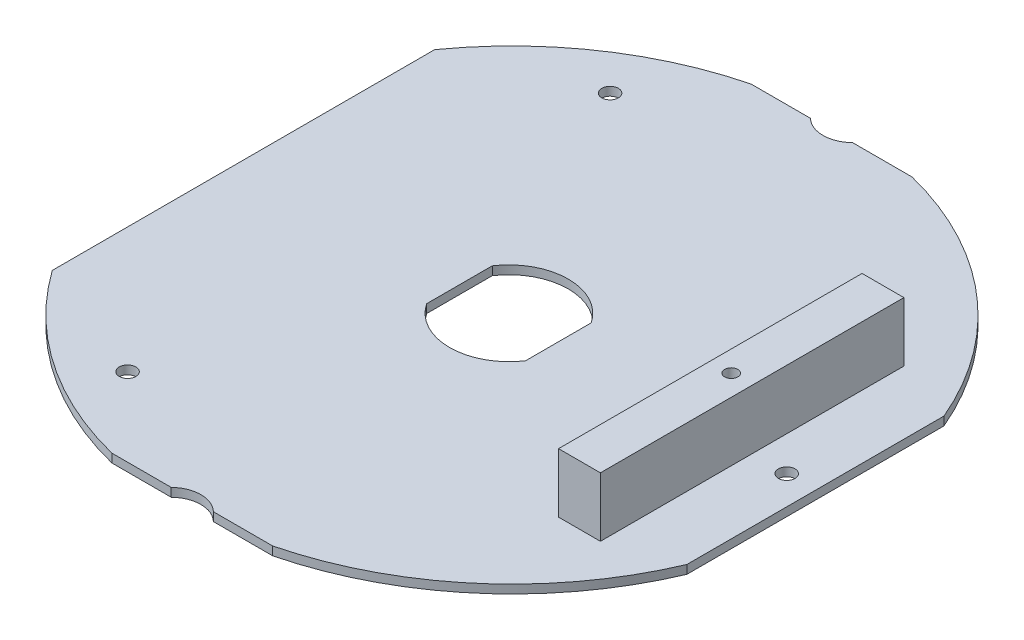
ISO-10303-21;
HEADER;
FILE_DESCRIPTION(('STEP AP214'),'2;1');
FILE_NAME('part.step','',(''),(''),'','','');
FILE_SCHEMA(('AUTOMOTIVE_DESIGN { 1 0 10303 214 1 1 1 1 }'));
ENDSEC;
DATA;
#1=APPLICATION_CONTEXT('core data for automotive mechanical design processes');
#2=APPLICATION_PROTOCOL_DEFINITION('international standard','automotive_design',2000,#1);
#3=PRODUCT_CONTEXT('',#1,'mechanical');
#4=PRODUCT('Part','Part','',(#3));
#5=PRODUCT_RELATED_PRODUCT_CATEGORY('part','',(#4));
#6=PRODUCT_DEFINITION_FORMATION('','',#4);
#7=PRODUCT_DEFINITION_CONTEXT('part definition',#1,'design');
#8=PRODUCT_DEFINITION('design','',#6,#7);
#9=PRODUCT_DEFINITION_SHAPE('','',#8);
#10=(LENGTH_UNIT() NAMED_UNIT(*) SI_UNIT(.MILLI.,.METRE.));
#11=(NAMED_UNIT(*) PLANE_ANGLE_UNIT() SI_UNIT($,.RADIAN.));
#12=(NAMED_UNIT(*) SI_UNIT($,.STERADIAN.) SOLID_ANGLE_UNIT());
#13=UNCERTAINTY_MEASURE_WITH_UNIT(LENGTH_MEASURE(1.E-05),#10,'distance_accuracy_value','');
#14=(GEOMETRIC_REPRESENTATION_CONTEXT(3) GLOBAL_UNCERTAINTY_ASSIGNED_CONTEXT((#13)) GLOBAL_UNIT_ASSIGNED_CONTEXT((#10,
#11,#12)) REPRESENTATION_CONTEXT('',''));
#15=CARTESIAN_POINT('',(0.,0.,0.));
#16=DIRECTION('',(0.,0.,1.));
#17=DIRECTION('',(1.,0.,0.));
#18=AXIS2_PLACEMENT_3D('',#15,#16,#17);
#19=CARTESIAN_POINT('',(0.,1.651,0.));
#20=DIRECTION('',(0.,1.,0.));
#21=DIRECTION('',(0.,0.,1.));
#22=AXIS2_PLACEMENT_3D('',#19,#20,#21);
#23=PLANE('',#22);
#24=DIRECTION('',(0.,0.,1.));
#25=VECTOR('',#24,1.);
#26=CARTESIAN_POINT('',(-10.1082566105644,1.651,6.31817022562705));
#27=LINE('',#26,#25);
#28=CARTESIAN_POINT('',(-10.1082566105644,1.651,-6.31817022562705));
#29=VERTEX_POINT('',#28);
#30=CARTESIAN_POINT('',(-10.1082566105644,1.651,6.31817022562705));
#31=VERTEX_POINT('',#30);
#32=EDGE_CURVE('E204',#29,#31,#27,.T.);
#33=ORIENTED_EDGE('',*,*,#32,.F.);
#34=CARTESIAN_POINT('',(-0.583256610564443,1.651,0.));
#35=DIRECTION('',(0.,1.,0.));
#36=DIRECTION('',(0.,0.,1.));
#37=AXIS2_PLACEMENT_3D('',#34,#35,#36);
#38=CIRCLE('',#37,11.43);
#39=CARTESIAN_POINT('',(8.94174338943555,1.651,-6.31817022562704));
#40=VERTEX_POINT('',#39);
#41=EDGE_CURVE('E202',#40,#29,#38,.T.);
#42=ORIENTED_EDGE('',*,*,#41,.F.);
#43=DIRECTION('',(0.,0.,-1.));
#44=VECTOR('',#43,1.);
#45=CARTESIAN_POINT('',(8.94174338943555,1.651,-6.31817022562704));
#46=LINE('',#45,#44);
#47=CARTESIAN_POINT('',(8.94174338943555,1.651,6.31817022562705));
#48=VERTEX_POINT('',#47);
#49=EDGE_CURVE('E209',#48,#40,#46,.T.);
#50=ORIENTED_EDGE('',*,*,#49,.F.);
#51=CARTESIAN_POINT('',(-0.583256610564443,1.651,0.));
#52=DIRECTION('',(0.,1.,0.));
#53=DIRECTION('',(0.,0.,1.));
#54=AXIS2_PLACEMENT_3D('',#51,#52,#53);
#55=CIRCLE('',#54,11.43);
#56=EDGE_CURVE('E207',#31,#48,#55,.T.);
#57=ORIENTED_EDGE('',*,*,#56,.F.);
#58=EDGE_LOOP('',(#33,#42,#50,#57));
#59=FACE_BOUND('',#58,.T.);
#60=CARTESIAN_POINT('',(-27.574642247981,1.651,-46.482));
#61=DIRECTION('',(0.,1.,0.));
#62=DIRECTION('',(0.,0.,1.));
#63=AXIS2_PLACEMENT_3D('',#60,#61,#62);
#64=CIRCLE('',#63,1.6002);
#65=CARTESIAN_POINT('',(-27.574642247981,1.651,-48.0822));
#66=VERTEX_POINT('',#65);
#67=EDGE_CURVE('E234',#66,#66,#64,.T.);
#68=ORIENTED_EDGE('',*,*,#67,.F.);
#69=EDGE_LOOP('',(#68));
#70=FACE_BOUND('',#69,.T.);
#71=CARTESIAN_POINT('',(0.,1.651,0.));
#72=DIRECTION('',(0.,1.,0.));
#73=DIRECTION('',(0.,0.,1.));
#74=AXIS2_PLACEMENT_3D('',#71,#72,#73);
#75=CIRCLE('',#74,63.5);
#76=CARTESIAN_POINT('',(15.494,1.651,61.5807272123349));
#77=VERTEX_POINT('',#76);
#78=CARTESIAN_POINT('',(58.4717433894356,1.651,24.765));
#79=VERTEX_POINT('',#78);
#80=EDGE_CURVE('E246',#77,#79,#75,.T.);
#81=ORIENTED_EDGE('',*,*,#80,.T.);
#82=DIRECTION('',(0.,0.,-1.));
#83=VECTOR('',#82,1.);
#84=CARTESIAN_POINT('',(58.4717433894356,1.651,0.));
#85=LINE('',#84,#83);
#86=CARTESIAN_POINT('',(58.4717433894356,1.651,-24.765));
#87=VERTEX_POINT('',#86);
#88=EDGE_CURVE('E249',#79,#87,#85,.T.);
#89=ORIENTED_EDGE('',*,*,#88,.T.);
#90=CARTESIAN_POINT('',(0.,1.651,0.));
#91=DIRECTION('',(0.,1.,0.));
#92=DIRECTION('',(0.,0.,1.));
#93=AXIS2_PLACEMENT_3D('',#90,#91,#92);
#94=CIRCLE('',#93,63.5);
#95=CARTESIAN_POINT('',(15.494,1.651,-61.5807272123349));
#96=VERTEX_POINT('',#95);
#97=EDGE_CURVE('E252',#87,#96,#94,.T.);
#98=ORIENTED_EDGE('',*,*,#97,.T.);
#99=DIRECTION('',(-1.,0.,0.));
#100=VECTOR('',#99,1.);
#101=CARTESIAN_POINT('',(15.494,1.651,-61.5807272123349));
#102=LINE('',#101,#100);
#103=CARTESIAN_POINT('',(4.064,1.651,-61.5807272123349));
#104=VERTEX_POINT('',#103);
#105=EDGE_CURVE('E254',#96,#104,#102,.T.);
#106=ORIENTED_EDGE('',*,*,#105,.T.);
#107=CARTESIAN_POINT('',(0.,1.651,-65.757073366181));
#108=DIRECTION('',(0.,-1.,0.));
#109=DIRECTION('',(0.,0.,1.));
#110=AXIS2_PLACEMENT_3D('',#107,#108,#109);
#111=CIRCLE('',#110,5.82734615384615);
#112=CARTESIAN_POINT('',(-4.06399999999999,1.651,-61.5807272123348));
#113=VERTEX_POINT('',#112);
#114=EDGE_CURVE('E256',#104,#113,#111,.T.);
#115=ORIENTED_EDGE('',*,*,#114,.T.);
#116=DIRECTION('',(-1.,0.,0.));
#117=VECTOR('',#116,1.);
#118=CARTESIAN_POINT('',(-4.064,1.651,-61.5807272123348));
#119=LINE('',#118,#117);
#120=CARTESIAN_POINT('',(-15.494,1.651,-61.5807272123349));
#121=VERTEX_POINT('',#120);
#122=EDGE_CURVE('E258',#113,#121,#119,.T.);
#123=ORIENTED_EDGE('',*,*,#122,.T.);
#124=CARTESIAN_POINT('',(0.,1.651,0.));
#125=DIRECTION('',(0.,1.,0.));
#126=DIRECTION('',(0.,0.,1.));
#127=AXIS2_PLACEMENT_3D('',#124,#125,#126);
#128=CIRCLE('',#127,63.5);
#129=CARTESIAN_POINT('',(-51.7281461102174,1.651,-36.83));
#130=VERTEX_POINT('',#129);
#131=EDGE_CURVE('E260',#121,#130,#128,.T.);
#132=ORIENTED_EDGE('',*,*,#131,.T.);
#133=DIRECTION('',(0.,0.,1.));
#134=VECTOR('',#133,1.);
#135=CARTESIAN_POINT('',(-51.7281461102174,1.651,-36.83));
#136=LINE('',#135,#134);
#137=CARTESIAN_POINT('',(-51.7281461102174,1.651,36.83));
#138=VERTEX_POINT('',#137);
#139=EDGE_CURVE('E262',#130,#138,#136,.T.);
#140=ORIENTED_EDGE('',*,*,#139,.T.);
#141=CARTESIAN_POINT('',(0.,1.651,0.));
#142=DIRECTION('',(0.,1.,0.));
#143=DIRECTION('',(0.,0.,1.));
#144=AXIS2_PLACEMENT_3D('',#141,#142,#143);
#145=CIRCLE('',#144,63.5);
#146=CARTESIAN_POINT('',(-15.494,1.651,61.5807272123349));
#147=VERTEX_POINT('',#146);
#148=EDGE_CURVE('E264',#138,#147,#145,.T.);
#149=ORIENTED_EDGE('',*,*,#148,.T.);
#150=DIRECTION('',(1.,0.,0.));
#151=VECTOR('',#150,1.);
#152=CARTESIAN_POINT('',(-4.064,1.651,61.5807272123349));
#153=LINE('',#152,#151);
#154=CARTESIAN_POINT('',(-4.064,1.651,61.5807272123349));
#155=VERTEX_POINT('',#154);
#156=EDGE_CURVE('E266',#147,#155,#153,.T.);
#157=ORIENTED_EDGE('',*,*,#156,.T.);
#158=CARTESIAN_POINT('',(0.,1.651,65.757073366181));
#159=DIRECTION('',(0.,-1.,0.));
#160=DIRECTION('',(0.,0.,1.));
#161=AXIS2_PLACEMENT_3D('',#158,#159,#160);
#162=CIRCLE('',#161,5.82734615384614);
#163=CARTESIAN_POINT('',(4.06399999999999,1.651,61.5807272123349));
#164=VERTEX_POINT('',#163);
#165=EDGE_CURVE('E268',#155,#164,#162,.T.);
#166=ORIENTED_EDGE('',*,*,#165,.T.);
#167=DIRECTION('',(1.,0.,0.));
#168=VECTOR('',#167,1.);
#169=CARTESIAN_POINT('',(15.494,1.651,61.5807272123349));
#170=LINE('',#169,#168);
#171=EDGE_CURVE('E270',#164,#77,#170,.T.);
#172=ORIENTED_EDGE('',*,*,#171,.T.);
#173=EDGE_LOOP('',(#81,#89,#98,#106,#115,#123,#132,#140,#149,#157,#166,#172));
#174=FACE_BOUND('',#173,.T.);
#175=CARTESIAN_POINT('',(-27.574642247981,1.651,46.482));
#176=DIRECTION('',(0.,1.,0.));
#177=DIRECTION('',(0.,0.,1.));
#178=AXIS2_PLACEMENT_3D('',#175,#176,#177);
#179=CIRCLE('',#178,1.6002);
#180=CARTESIAN_POINT('',(-27.574642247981,1.651,44.8818));
#181=VERTEX_POINT('',#180);
#182=EDGE_CURVE('E240',#181,#181,#179,.T.);
#183=ORIENTED_EDGE('',*,*,#182,.F.);
#184=EDGE_LOOP('',(#183));
#185=FACE_BOUND('',#184,.T.);
#186=CARTESIAN_POINT('',(52.9345433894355,1.651,0.));
#187=DIRECTION('',(0.,1.,0.));
#188=DIRECTION('',(0.,0.,1.));
#189=AXIS2_PLACEMENT_3D('',#186,#187,#188);
#190=CIRCLE('',#189,1.6002);
#191=CARTESIAN_POINT('',(52.9345433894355,1.651,-1.6002));
#192=VERTEX_POINT('',#191);
#193=EDGE_CURVE('E228',#192,#192,#190,.T.);
#194=ORIENTED_EDGE('',*,*,#193,.F.);
#195=EDGE_LOOP('',(#194));
#196=FACE_BOUND('',#195,.T.);
#197=DIRECTION('',(1.,0.,0.));
#198=VECTOR('',#197,1.);
#199=CARTESIAN_POINT('',(38.2152433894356,1.651,29.2354));
#200=LINE('',#199,#198);
#201=CARTESIAN_POINT('',(38.2152433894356,1.651,29.2354));
#202=VERTEX_POINT('',#201);
#203=CARTESIAN_POINT('',(46.2797433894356,1.651,29.2354));
#204=VERTEX_POINT('',#203);
#205=EDGE_CURVE('E645',#202,#204,#200,.T.);
#206=ORIENTED_EDGE('',*,*,#205,.F.);
#207=DIRECTION('',(0.,0.,1.));
#208=VECTOR('',#207,1.);
#209=CARTESIAN_POINT('',(38.2152433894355,1.651,-29.2354));
#210=LINE('',#209,#208);
#211=CARTESIAN_POINT('',(38.2152433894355,1.651,-29.2354));
#212=VERTEX_POINT('',#211);
#213=EDGE_CURVE('E192',#212,#202,#210,.T.);
#214=ORIENTED_EDGE('',*,*,#213,.F.);
#215=DIRECTION('',(-1.,0.,0.));
#216=VECTOR('',#215,1.);
#217=CARTESIAN_POINT('',(38.2152433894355,1.651,-29.2354));
#218=LINE('',#217,#216);
#219=CARTESIAN_POINT('',(46.2797433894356,1.651,-29.2354));
#220=VERTEX_POINT('',#219);
#221=EDGE_CURVE('E188',#220,#212,#218,.T.);
#222=ORIENTED_EDGE('',*,*,#221,.F.);
#223=DIRECTION('',(0.,0.,-1.));
#224=VECTOR('',#223,1.);
#225=CARTESIAN_POINT('',(46.2797433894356,1.651,-29.2354));
#226=LINE('',#225,#224);
#227=EDGE_CURVE('E654',#204,#220,#226,.T.);
#228=ORIENTED_EDGE('',*,*,#227,.F.);
#229=EDGE_LOOP('',(#206,#214,#222,#228));
#230=FACE_BOUND('',#229,.T.);
#231=ADVANCED_FACE('F32',(#59,#70,#174,#185,#196,#230),#23,.T.);
#232=CARTESIAN_POINT('',(0.,0.,0.));
#233=DIRECTION('',(0.,1.,0.));
#234=DIRECTION('',(0.,0.,1.));
#235=AXIS2_PLACEMENT_3D('',#232,#233,#234);
#236=PLANE('',#235);
#237=CARTESIAN_POINT('',(52.9345433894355,0.,0.));
#238=DIRECTION('',(0.,1.,0.));
#239=DIRECTION('',(0.,0.,1.));
#240=AXIS2_PLACEMENT_3D('',#237,#238,#239);
#241=CIRCLE('',#240,1.6002);
#242=CARTESIAN_POINT('',(52.9345433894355,0.,-1.6002));
#243=VERTEX_POINT('',#242);
#244=EDGE_CURVE('E227',#243,#243,#241,.T.);
#245=ORIENTED_EDGE('',*,*,#244,.T.);
#246=EDGE_LOOP('',(#245));
#247=FACE_BOUND('',#246,.T.);
#248=CARTESIAN_POINT('',(-27.574642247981,0.,46.482));
#249=DIRECTION('',(0.,1.,0.));
#250=DIRECTION('',(0.,0.,1.));
#251=AXIS2_PLACEMENT_3D('',#248,#249,#250);
#252=CIRCLE('',#251,1.6002);
#253=CARTESIAN_POINT('',(-27.574642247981,0.,44.8818));
#254=VERTEX_POINT('',#253);
#255=EDGE_CURVE('E237',#254,#254,#252,.T.);
#256=ORIENTED_EDGE('',*,*,#255,.T.);
#257=EDGE_LOOP('',(#256));
#258=FACE_BOUND('',#257,.T.);
#259=CARTESIAN_POINT('',(0.,0.,0.));
#260=DIRECTION('',(0.,1.,0.));
#261=DIRECTION('',(0.,0.,1.));
#262=AXIS2_PLACEMENT_3D('',#259,#260,#261);
#263=CIRCLE('',#262,63.5);
#264=CARTESIAN_POINT('',(15.494,0.,61.5807272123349));
#265=VERTEX_POINT('',#264);
#266=CARTESIAN_POINT('',(58.4717433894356,0.,24.765));
#267=VERTEX_POINT('',#266);
#268=EDGE_CURVE('E243',#265,#267,#263,.T.);
#269=ORIENTED_EDGE('',*,*,#268,.F.);
#270=DIRECTION('',(1.,0.,0.));
#271=VECTOR('',#270,1.);
#272=CARTESIAN_POINT('',(15.494,0.,61.5807272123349));
#273=LINE('',#272,#271);
#274=CARTESIAN_POINT('',(4.06399999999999,0.,61.5807272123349));
#275=VERTEX_POINT('',#274);
#276=EDGE_CURVE('E250',#275,#265,#273,.T.);
#277=ORIENTED_EDGE('',*,*,#276,.F.);
#278=CARTESIAN_POINT('',(0.,0.,65.757073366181));
#279=DIRECTION('',(0.,-1.,0.));
#280=DIRECTION('',(0.,0.,1.));
#281=AXIS2_PLACEMENT_3D('',#278,#279,#280);
#282=CIRCLE('',#281,5.82734615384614);
#283=CARTESIAN_POINT('',(-4.064,0.,61.5807272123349));
#284=VERTEX_POINT('',#283);
#285=EDGE_CURVE('E294',#284,#275,#282,.T.);
#286=ORIENTED_EDGE('',*,*,#285,.F.);
#287=DIRECTION('',(1.,0.,0.));
#288=VECTOR('',#287,1.);
#289=CARTESIAN_POINT('',(-4.064,0.,61.5807272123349));
#290=LINE('',#289,#288);
#291=CARTESIAN_POINT('',(-15.494,0.,61.5807272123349));
#292=VERTEX_POINT('',#291);
#293=EDGE_CURVE('E292',#292,#284,#290,.T.);
#294=ORIENTED_EDGE('',*,*,#293,.F.);
#295=CARTESIAN_POINT('',(0.,0.,0.));
#296=DIRECTION('',(0.,1.,0.));
#297=DIRECTION('',(0.,0.,1.));
#298=AXIS2_PLACEMENT_3D('',#295,#296,#297);
#299=CIRCLE('',#298,63.5);
#300=CARTESIAN_POINT('',(-51.7281461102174,0.,36.83));
#301=VERTEX_POINT('',#300);
#302=EDGE_CURVE('E290',#301,#292,#299,.T.);
#303=ORIENTED_EDGE('',*,*,#302,.F.);
#304=DIRECTION('',(0.,0.,1.));
#305=VECTOR('',#304,1.);
#306=CARTESIAN_POINT('',(-51.7281461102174,0.,0.));
#307=LINE('',#306,#305);
#308=CARTESIAN_POINT('',(-51.7281461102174,0.,-36.83));
#309=VERTEX_POINT('',#308);
#310=EDGE_CURVE('E288',#309,#301,#307,.T.);
#311=ORIENTED_EDGE('',*,*,#310,.F.);
#312=CARTESIAN_POINT('',(0.,0.,0.));
#313=DIRECTION('',(0.,1.,0.));
#314=DIRECTION('',(0.,0.,1.));
#315=AXIS2_PLACEMENT_3D('',#312,#313,#314);
#316=CIRCLE('',#315,63.5);
#317=CARTESIAN_POINT('',(-15.494,0.,-61.5807272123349));
#318=VERTEX_POINT('',#317);
#319=EDGE_CURVE('E285',#318,#309,#316,.T.);
#320=ORIENTED_EDGE('',*,*,#319,.F.);
#321=DIRECTION('',(-1.,0.,0.));
#322=VECTOR('',#321,1.);
#323=CARTESIAN_POINT('',(-4.064,0.,-61.5807272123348));
#324=LINE('',#323,#322);
#325=CARTESIAN_POINT('',(-4.06399999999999,0.,-61.5807272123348));
#326=VERTEX_POINT('',#325);
#327=EDGE_CURVE('E283',#326,#318,#324,.T.);
#328=ORIENTED_EDGE('',*,*,#327,.F.);
#329=CARTESIAN_POINT('',(0.,0.,-65.757073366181));
#330=DIRECTION('',(0.,-1.,0.));
#331=DIRECTION('',(0.,0.,1.));
#332=AXIS2_PLACEMENT_3D('',#329,#330,#331);
#333=CIRCLE('',#332,5.82734615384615);
#334=CARTESIAN_POINT('',(4.064,0.,-61.5807272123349));
#335=VERTEX_POINT('',#334);
#336=EDGE_CURVE('E281',#335,#326,#333,.T.);
#337=ORIENTED_EDGE('',*,*,#336,.F.);
#338=DIRECTION('',(-1.,0.,0.));
#339=VECTOR('',#338,1.);
#340=CARTESIAN_POINT('',(15.494,0.,-61.5807272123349));
#341=LINE('',#340,#339);
#342=CARTESIAN_POINT('',(15.494,0.,-61.5807272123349));
#343=VERTEX_POINT('',#342);
#344=EDGE_CURVE('E279',#343,#335,#341,.T.);
#345=ORIENTED_EDGE('',*,*,#344,.F.);
#346=CARTESIAN_POINT('',(0.,0.,0.));
#347=DIRECTION('',(0.,1.,0.));
#348=DIRECTION('',(0.,0.,1.));
#349=AXIS2_PLACEMENT_3D('',#346,#347,#348);
#350=CIRCLE('',#349,63.5);
#351=CARTESIAN_POINT('',(58.4717433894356,0.,-24.765));
#352=VERTEX_POINT('',#351);
#353=EDGE_CURVE('E277',#352,#343,#350,.T.);
#354=ORIENTED_EDGE('',*,*,#353,.F.);
#355=DIRECTION('',(0.,0.,-1.));
#356=VECTOR('',#355,1.);
#357=CARTESIAN_POINT('',(58.4717433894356,0.,-24.765));
#358=LINE('',#357,#356);
#359=EDGE_CURVE('E275',#267,#352,#358,.T.);
#360=ORIENTED_EDGE('',*,*,#359,.F.);
#361=EDGE_LOOP('',(#269,#277,#286,#294,#303,#311,#320,#328,#337,#345,#354,#360));
#362=FACE_BOUND('',#361,.T.);
#363=CARTESIAN_POINT('',(-27.574642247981,0.,-46.482));
#364=DIRECTION('',(0.,1.,0.));
#365=DIRECTION('',(0.,0.,1.));
#366=AXIS2_PLACEMENT_3D('',#363,#364,#365);
#367=CIRCLE('',#366,1.6002);
#368=CARTESIAN_POINT('',(-27.574642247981,0.,-48.0822));
#369=VERTEX_POINT('',#368);
#370=EDGE_CURVE('E231',#369,#369,#367,.T.);
#371=ORIENTED_EDGE('',*,*,#370,.T.);
#372=EDGE_LOOP('',(#371));
#373=FACE_BOUND('',#372,.T.);
#374=CARTESIAN_POINT('',(-0.583256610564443,0.,0.));
#375=DIRECTION('',(0.,1.,0.));
#376=DIRECTION('',(0.,0.,1.));
#377=AXIS2_PLACEMENT_3D('',#374,#375,#376);
#378=CIRCLE('',#377,11.43);
#379=CARTESIAN_POINT('',(8.94174338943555,0.,-6.31817022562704));
#380=VERTEX_POINT('',#379);
#381=CARTESIAN_POINT('',(-10.1082566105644,0.,-6.31817022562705));
#382=VERTEX_POINT('',#381);
#383=EDGE_CURVE('E194',#380,#382,#378,.T.);
#384=ORIENTED_EDGE('',*,*,#383,.T.);
#385=DIRECTION('',(0.,0.,1.));
#386=VECTOR('',#385,1.);
#387=CARTESIAN_POINT('',(-10.1082566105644,0.,6.31817022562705));
#388=LINE('',#387,#386);
#389=CARTESIAN_POINT('',(-10.1082566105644,0.,6.31817022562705));
#390=VERTEX_POINT('',#389);
#391=EDGE_CURVE('E197',#382,#390,#388,.T.);
#392=ORIENTED_EDGE('',*,*,#391,.T.);
#393=CARTESIAN_POINT('',(-0.583256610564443,0.,0.));
#394=DIRECTION('',(0.,1.,0.));
#395=DIRECTION('',(0.,0.,1.));
#396=AXIS2_PLACEMENT_3D('',#393,#394,#395);
#397=CIRCLE('',#396,11.43);
#398=CARTESIAN_POINT('',(8.94174338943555,0.,6.31817022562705));
#399=VERTEX_POINT('',#398);
#400=EDGE_CURVE('E214',#390,#399,#397,.T.);
#401=ORIENTED_EDGE('',*,*,#400,.T.);
#402=DIRECTION('',(0.,0.,-1.));
#403=VECTOR('',#402,1.);
#404=CARTESIAN_POINT('',(8.94174338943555,0.,-6.31817022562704));
#405=LINE('',#404,#403);
#406=EDGE_CURVE('E205',#399,#380,#405,.T.);
#407=ORIENTED_EDGE('',*,*,#406,.T.);
#408=EDGE_LOOP('',(#384,#392,#401,#407));
#409=FACE_BOUND('',#408,.T.);
#410=ADVANCED_FACE('F336',(#247,#258,#362,#373,#409),#236,.F.);
#411=CARTESIAN_POINT('',(0.,1.651,0.));
#412=DIRECTION('',(0.,-1.,0.));
#413=DIRECTION('',(0.,0.,-1.));
#414=AXIS2_PLACEMENT_3D('',#411,#412,#413);
#415=CYLINDRICAL_SURFACE('',#414,63.5);
#416=ORIENTED_EDGE('',*,*,#268,.T.);
#417=DIRECTION('',(0.,-1.,0.));
#418=VECTOR('',#417,1.);
#419=CARTESIAN_POINT('',(58.4717433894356,1.651,24.765));
#420=LINE('',#419,#418);
#421=EDGE_CURVE('E11',#79,#267,#420,.T.);
#422=ORIENTED_EDGE('',*,*,#421,.F.);
#423=ORIENTED_EDGE('',*,*,#80,.F.);
#424=DIRECTION('',(0.,-1.,0.));
#425=VECTOR('',#424,1.);
#426=CARTESIAN_POINT('',(15.494,1.651,61.5807272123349));
#427=LINE('',#426,#425);
#428=EDGE_CURVE('E272',#77,#265,#427,.T.);
#429=ORIENTED_EDGE('',*,*,#428,.T.);
#430=EDGE_LOOP('',(#416,#422,#423,#429));
#431=FACE_BOUND('',#430,.T.);
#432=ADVANCED_FACE('F34',(#431),#415,.T.);
#433=CARTESIAN_POINT('',(58.4717433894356,1.651,-24.765));
#434=DIRECTION('',(-1.,0.,0.));
#435=DIRECTION('',(0.,0.,1.));
#436=AXIS2_PLACEMENT_3D('',#433,#434,#435);
#437=PLANE('',#436);
#438=ORIENTED_EDGE('',*,*,#359,.T.);
#439=DIRECTION('',(0.,-1.,0.));
#440=VECTOR('',#439,1.);
#441=CARTESIAN_POINT('',(58.4717433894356,1.651,-24.765));
#442=LINE('',#441,#440);
#443=EDGE_CURVE('E40',#87,#352,#442,.T.);
#444=ORIENTED_EDGE('',*,*,#443,.F.);
#445=ORIENTED_EDGE('',*,*,#88,.F.);
#446=ORIENTED_EDGE('',*,*,#421,.T.);
#447=EDGE_LOOP('',(#438,#444,#445,#446));
#448=FACE_BOUND('',#447,.T.);
#449=ADVANCED_FACE('F354',(#448),#437,.F.);
#450=CARTESIAN_POINT('',(0.,1.651,0.));
#451=DIRECTION('',(0.,-1.,0.));
#452=DIRECTION('',(0.,0.,-1.));
#453=AXIS2_PLACEMENT_3D('',#450,#451,#452);
#454=CYLINDRICAL_SURFACE('',#453,63.5);
#455=ORIENTED_EDGE('',*,*,#353,.T.);
#456=DIRECTION('',(0.,-1.,0.));
#457=VECTOR('',#456,1.);
#458=CARTESIAN_POINT('',(15.494,1.651,-61.5807272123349));
#459=LINE('',#458,#457);
#460=EDGE_CURVE('E323',#96,#343,#459,.T.);
#461=ORIENTED_EDGE('',*,*,#460,.F.);
#462=ORIENTED_EDGE('',*,*,#97,.F.);
#463=ORIENTED_EDGE('',*,*,#443,.T.);
#464=EDGE_LOOP('',(#455,#461,#462,#463));
#465=FACE_BOUND('',#464,.T.);
#466=ADVANCED_FACE('F330',(#465),#454,.T.);
#467=CARTESIAN_POINT('',(15.494,1.651,-61.5807272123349));
#468=DIRECTION('',(0.,0.,1.));
#469=DIRECTION('',(1.,0.,0.));
#470=AXIS2_PLACEMENT_3D('',#467,#468,#469);
#471=PLANE('',#470);
#472=ORIENTED_EDGE('',*,*,#344,.T.);
#473=DIRECTION('',(0.,-1.,0.));
#474=VECTOR('',#473,1.);
#475=CARTESIAN_POINT('',(4.064,1.651,-61.5807272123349));
#476=LINE('',#475,#474);
#477=EDGE_CURVE('E320',#104,#335,#476,.T.);
#478=ORIENTED_EDGE('',*,*,#477,.F.);
#479=ORIENTED_EDGE('',*,*,#105,.F.);
#480=ORIENTED_EDGE('',*,*,#460,.T.);
#481=EDGE_LOOP('',(#472,#478,#479,#480));
#482=FACE_BOUND('',#481,.T.);
#483=ADVANCED_FACE('F342',(#482),#471,.F.);
#484=CARTESIAN_POINT('',(0.,1.651,-65.757073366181));
#485=DIRECTION('',(0.,-1.,0.));
#486=DIRECTION('',(0.,0.,-1.));
#487=AXIS2_PLACEMENT_3D('',#484,#485,#486);
#488=CYLINDRICAL_SURFACE('',#487,5.82734615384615);
#489=ORIENTED_EDGE('',*,*,#336,.T.);
#490=DIRECTION('',(0.,-1.,0.));
#491=VECTOR('',#490,1.);
#492=CARTESIAN_POINT('',(-4.06399999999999,1.651,-61.5807272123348));
#493=LINE('',#492,#491);
#494=EDGE_CURVE('E317',#113,#326,#493,.T.);
#495=ORIENTED_EDGE('',*,*,#494,.F.);
#496=ORIENTED_EDGE('',*,*,#114,.F.);
#497=ORIENTED_EDGE('',*,*,#477,.T.);
#498=EDGE_LOOP('',(#489,#495,#496,#497));
#499=FACE_BOUND('',#498,.T.);
#500=ADVANCED_FACE('F346',(#499),#488,.F.);
#501=CARTESIAN_POINT('',(-4.064,1.651,-61.5807272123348));
#502=DIRECTION('',(0.,0.,1.));
#503=DIRECTION('',(1.,0.,0.));
#504=AXIS2_PLACEMENT_3D('',#501,#502,#503);
#505=PLANE('',#504);
#506=ORIENTED_EDGE('',*,*,#327,.T.);
#507=DIRECTION('',(0.,-1.,0.));
#508=VECTOR('',#507,1.);
#509=CARTESIAN_POINT('',(-15.494,1.651,-61.5807272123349));
#510=LINE('',#509,#508);
#511=EDGE_CURVE('E314',#121,#318,#510,.T.);
#512=ORIENTED_EDGE('',*,*,#511,.F.);
#513=ORIENTED_EDGE('',*,*,#122,.F.);
#514=ORIENTED_EDGE('',*,*,#494,.T.);
#515=EDGE_LOOP('',(#506,#512,#513,#514));
#516=FACE_BOUND('',#515,.T.);
#517=ADVANCED_FACE('F386',(#516),#505,.F.);
#518=CARTESIAN_POINT('',(0.,1.651,0.));
#519=DIRECTION('',(0.,-1.,0.));
#520=DIRECTION('',(0.,0.,-1.));
#521=AXIS2_PLACEMENT_3D('',#518,#519,#520);
#522=CYLINDRICAL_SURFACE('',#521,63.5);
#523=ORIENTED_EDGE('',*,*,#319,.T.);
#524=DIRECTION('',(0.,-1.,0.));
#525=VECTOR('',#524,1.);
#526=CARTESIAN_POINT('',(-51.7281461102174,1.651,-36.83));
#527=LINE('',#526,#525);
#528=EDGE_CURVE('E311',#130,#309,#527,.T.);
#529=ORIENTED_EDGE('',*,*,#528,.F.);
#530=ORIENTED_EDGE('',*,*,#131,.F.);
#531=ORIENTED_EDGE('',*,*,#511,.T.);
#532=EDGE_LOOP('',(#523,#529,#530,#531));
#533=FACE_BOUND('',#532,.T.);
#534=ADVANCED_FACE('F384',(#533),#522,.T.);
#535=CARTESIAN_POINT('',(-51.7281461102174,1.651,0.));
#536=DIRECTION('',(1.,0.,0.));
#537=DIRECTION('',(0.,0.,-1.));
#538=AXIS2_PLACEMENT_3D('',#535,#536,#537);
#539=PLANE('',#538);
#540=ORIENTED_EDGE('',*,*,#310,.T.);
#541=DIRECTION('',(0.,-1.,0.));
#542=VECTOR('',#541,1.);
#543=CARTESIAN_POINT('',(-51.7281461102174,1.651,36.83));
#544=LINE('',#543,#542);
#545=EDGE_CURVE('E308',#138,#301,#544,.T.);
#546=ORIENTED_EDGE('',*,*,#545,.F.);
#547=ORIENTED_EDGE('',*,*,#139,.F.);
#548=ORIENTED_EDGE('',*,*,#528,.T.);
#549=EDGE_LOOP('',(#540,#546,#547,#548));
#550=FACE_BOUND('',#549,.T.);
#551=ADVANCED_FACE('F380',(#550),#539,.F.);
#552=CARTESIAN_POINT('',(0.,1.651,0.));
#553=DIRECTION('',(0.,-1.,0.));
#554=DIRECTION('',(0.,0.,-1.));
#555=AXIS2_PLACEMENT_3D('',#552,#553,#554);
#556=CYLINDRICAL_SURFACE('',#555,63.5);
#557=ORIENTED_EDGE('',*,*,#302,.T.);
#558=DIRECTION('',(0.,-1.,0.));
#559=VECTOR('',#558,1.);
#560=CARTESIAN_POINT('',(-15.494,1.651,61.5807272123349));
#561=LINE('',#560,#559);
#562=EDGE_CURVE('E305',#147,#292,#561,.T.);
#563=ORIENTED_EDGE('',*,*,#562,.F.);
#564=ORIENTED_EDGE('',*,*,#148,.F.);
#565=ORIENTED_EDGE('',*,*,#545,.T.);
#566=EDGE_LOOP('',(#557,#563,#564,#565));
#567=FACE_BOUND('',#566,.T.);
#568=ADVANCED_FACE('F375',(#567),#556,.T.);
#569=CARTESIAN_POINT('',(-4.064,1.651,61.5807272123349));
#570=DIRECTION('',(0.,0.,-1.));
#571=DIRECTION('',(-1.,0.,0.));
#572=AXIS2_PLACEMENT_3D('',#569,#570,#571);
#573=PLANE('',#572);
#574=ORIENTED_EDGE('',*,*,#293,.T.);
#575=DIRECTION('',(0.,-1.,0.));
#576=VECTOR('',#575,1.);
#577=CARTESIAN_POINT('',(-4.064,1.651,61.5807272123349));
#578=LINE('',#577,#576);
#579=EDGE_CURVE('E302',#155,#284,#578,.T.);
#580=ORIENTED_EDGE('',*,*,#579,.F.);
#581=ORIENTED_EDGE('',*,*,#156,.F.);
#582=ORIENTED_EDGE('',*,*,#562,.T.);
#583=EDGE_LOOP('',(#574,#580,#581,#582));
#584=FACE_BOUND('',#583,.T.);
#585=ADVANCED_FACE('F370',(#584),#573,.F.);
#586=CARTESIAN_POINT('',(0.,1.651,65.757073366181));
#587=DIRECTION('',(0.,-1.,0.));
#588=DIRECTION('',(0.,0.,-1.));
#589=AXIS2_PLACEMENT_3D('',#586,#587,#588);
#590=CYLINDRICAL_SURFACE('',#589,5.82734615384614);
#591=ORIENTED_EDGE('',*,*,#285,.T.);
#592=DIRECTION('',(0.,-1.,0.));
#593=VECTOR('',#592,1.);
#594=CARTESIAN_POINT('',(4.06399999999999,1.651,61.5807272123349));
#595=LINE('',#594,#593);
#596=EDGE_CURVE('E299',#164,#275,#595,.T.);
#597=ORIENTED_EDGE('',*,*,#596,.F.);
#598=ORIENTED_EDGE('',*,*,#165,.F.);
#599=ORIENTED_EDGE('',*,*,#579,.T.);
#600=EDGE_LOOP('',(#591,#597,#598,#599));
#601=FACE_BOUND('',#600,.T.);
#602=ADVANCED_FACE('F366',(#601),#590,.F.);
#603=CARTESIAN_POINT('',(15.494,1.651,61.5807272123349));
#604=DIRECTION('',(0.,0.,-1.));
#605=DIRECTION('',(-1.,0.,0.));
#606=AXIS2_PLACEMENT_3D('',#603,#604,#605);
#607=PLANE('',#606);
#608=ORIENTED_EDGE('',*,*,#276,.T.);
#609=ORIENTED_EDGE('',*,*,#428,.F.);
#610=ORIENTED_EDGE('',*,*,#171,.F.);
#611=ORIENTED_EDGE('',*,*,#596,.T.);
#612=EDGE_LOOP('',(#608,#609,#610,#611));
#613=FACE_BOUND('',#612,.T.);
#614=ADVANCED_FACE('F361',(#613),#607,.F.);
#615=CARTESIAN_POINT('',(-27.574642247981,1.651,46.482));
#616=DIRECTION('',(0.,-1.,0.));
#617=DIRECTION('',(0.,0.,-1.));
#618=AXIS2_PLACEMENT_3D('',#615,#616,#617);
#619=CYLINDRICAL_SURFACE('',#618,1.6002);
#620=CARTESIAN_POINT('',(-27.574642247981,1.651,44.8818));
#621=CARTESIAN_POINT('',(-27.574642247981,1.63380208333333,44.8818));
#622=CARTESIAN_POINT('',(-27.574642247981,1.61660416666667,44.8818));
#623=CARTESIAN_POINT('',(-27.574642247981,1.58220833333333,44.8818));
#624=CARTESIAN_POINT('',(-27.574642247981,1.56501041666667,44.8818));
#625=CARTESIAN_POINT('',(-27.574642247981,1.53061458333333,44.8818));
#626=CARTESIAN_POINT('',(-27.574642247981,1.51341666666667,44.8818));
#627=CARTESIAN_POINT('',(-27.574642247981,1.47902083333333,44.8818));
#628=CARTESIAN_POINT('',(-27.574642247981,1.46182291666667,44.8818));
#629=CARTESIAN_POINT('',(-27.574642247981,1.42742708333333,44.8818));
#630=CARTESIAN_POINT('',(-27.574642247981,1.41022916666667,44.8818));
#631=CARTESIAN_POINT('',(-27.574642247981,1.37583333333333,44.8818));
#632=CARTESIAN_POINT('',(-27.574642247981,1.35863541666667,44.8818));
#633=CARTESIAN_POINT('',(-27.574642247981,1.32423958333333,44.8818));
#634=CARTESIAN_POINT('',(-27.574642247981,1.30704166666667,44.8818));
#635=CARTESIAN_POINT('',(-27.574642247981,1.27264583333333,44.8818));
#636=CARTESIAN_POINT('',(-27.574642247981,1.25544791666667,44.8818));
#637=CARTESIAN_POINT('',(-27.574642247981,1.22105208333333,44.8818));
#638=CARTESIAN_POINT('',(-27.574642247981,1.20385416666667,44.8818));
#639=CARTESIAN_POINT('',(-27.574642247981,1.16945833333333,44.8818));
#640=CARTESIAN_POINT('',(-27.574642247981,1.15226041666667,44.8818));
#641=CARTESIAN_POINT('',(-27.574642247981,1.11786458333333,44.8818));
#642=CARTESIAN_POINT('',(-27.574642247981,1.10066666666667,44.8818));
#643=CARTESIAN_POINT('',(-27.574642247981,1.06627083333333,44.8818));
#644=CARTESIAN_POINT('',(-27.574642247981,1.04907291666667,44.8818));
#645=CARTESIAN_POINT('',(-27.574642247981,1.01467708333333,44.8818));
#646=CARTESIAN_POINT('',(-27.574642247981,0.997479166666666,44.8818));
#647=CARTESIAN_POINT('',(-27.574642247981,0.963083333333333,44.8818));
#648=CARTESIAN_POINT('',(-27.574642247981,0.945885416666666,44.8818));
#649=CARTESIAN_POINT('',(-27.574642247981,0.911489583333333,44.8818));
#650=CARTESIAN_POINT('',(-27.574642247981,0.894291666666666,44.8818));
#651=CARTESIAN_POINT('',(-27.574642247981,0.859895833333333,44.8818));
#652=CARTESIAN_POINT('',(-27.574642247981,0.842697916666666,44.8818));
#653=CARTESIAN_POINT('',(-27.574642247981,0.808302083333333,44.8818));
#654=CARTESIAN_POINT('',(-27.574642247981,0.791104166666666,44.8818));
#655=CARTESIAN_POINT('',(-27.574642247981,0.756708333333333,44.8818));
#656=CARTESIAN_POINT('',(-27.574642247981,0.739510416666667,44.8818));
#657=CARTESIAN_POINT('',(-27.574642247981,0.705114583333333,44.8818));
#658=CARTESIAN_POINT('',(-27.574642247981,0.687916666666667,44.8818));
#659=CARTESIAN_POINT('',(-27.574642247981,0.653520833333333,44.8818));
#660=CARTESIAN_POINT('',(-27.574642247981,0.636322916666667,44.8818));
#661=CARTESIAN_POINT('',(-27.574642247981,0.601927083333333,44.8818));
#662=CARTESIAN_POINT('',(-27.574642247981,0.584729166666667,44.8818));
#663=CARTESIAN_POINT('',(-27.574642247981,0.550333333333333,44.8818));
#664=CARTESIAN_POINT('',(-27.574642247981,0.533135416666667,44.8818));
#665=CARTESIAN_POINT('',(-27.574642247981,0.498739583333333,44.8818));
#666=CARTESIAN_POINT('',(-27.574642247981,0.481541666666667,44.8818));
#667=CARTESIAN_POINT('',(-27.574642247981,0.447145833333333,44.8818));
#668=CARTESIAN_POINT('',(-27.574642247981,0.429947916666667,44.8818));
#669=CARTESIAN_POINT('',(-27.574642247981,0.395552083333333,44.8818));
#670=CARTESIAN_POINT('',(-27.574642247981,0.378354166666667,44.8818));
#671=CARTESIAN_POINT('',(-27.574642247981,0.343958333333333,44.8818));
#672=CARTESIAN_POINT('',(-27.574642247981,0.326760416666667,44.8818));
#673=CARTESIAN_POINT('',(-27.574642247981,0.292364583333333,44.8818));
#674=CARTESIAN_POINT('',(-27.574642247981,0.275166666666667,44.8818));
#675=CARTESIAN_POINT('',(-27.574642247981,0.240770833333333,44.8818));
#676=CARTESIAN_POINT('',(-27.574642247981,0.223572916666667,44.8818));
#677=CARTESIAN_POINT('',(-27.574642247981,0.189177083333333,44.8818));
#678=CARTESIAN_POINT('',(-27.574642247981,0.171979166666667,44.8818));
#679=CARTESIAN_POINT('',(-27.574642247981,0.137583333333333,44.8818));
#680=CARTESIAN_POINT('',(-27.574642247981,0.120385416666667,44.8818));
#681=CARTESIAN_POINT('',(-27.574642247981,0.0859895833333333,44.8818));
#682=CARTESIAN_POINT('',(-27.574642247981,0.0687916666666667,44.8818));
#683=CARTESIAN_POINT('',(-27.574642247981,0.0343958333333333,44.8818));
#684=CARTESIAN_POINT('',(-27.574642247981,0.0171979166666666,44.8818));
#685=CARTESIAN_POINT('',(-27.574642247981,0.,44.8818));
#686=B_SPLINE_CURVE_WITH_KNOTS('',3,(#620,#621,#622,#623,#624,#625,#626,#627,#628,#629,#630,
#631,#632,#633,#634,#635,#636,#637,#638,#639,#640,#641,#642,#643,#644,#645,#646,#647,#648,#649,
#650,#651,#652,#653,#654,#655,#656,#657,#658,#659,#660,#661,#662,#663,#664,#665,#666,#667,#668,
#669,#670,#671,#672,#673,#674,#675,#676,#677,#678,#679,#680,#681,#682,#683,#684,#685),
.UNSPECIFIED.,.F.,.F.,(4,2,2,2,2,2,2,2,2,2,2,2,2,2,2,2,2,2,2,2,2,2,2,2,2,2,2,2,2,2,2,2,4),(0.,
0.0515937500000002,0.1031875,0.15478125,0.206375,0.25796875,0.3095625,0.36115625,0.41275,
0.46434375,0.5159375,0.56753125,0.619125,0.67071875,0.7223125,0.77390625,0.8255,0.87709375,
0.9286875,0.98028125,1.031875,1.08346875,1.1350625,1.18665625,1.23825,1.28984375,1.3414375,
1.39303125,1.444625,1.49621875,1.5478125,1.59940625,1.651),.UNSPECIFIED.);
#687=EDGE_CURVE('BSEAM406',#181,#254,#686,.T.);
#688=ORIENTED_EDGE('',*,*,#182,.T.);
#689=ORIENTED_EDGE('',*,*,#255,.F.);
#690=ORIENTED_EDGE('',*,*,#687,.T.);
#691=ORIENTED_EDGE('',*,*,#687,.F.);
#692=EDGE_LOOP('',(#688,#690,#689,#691));
#693=FACE_BOUND('',#692,.T.);
#694=ADVANCED_FACE('F406',(#693),#619,.F.);
#695=CARTESIAN_POINT('',(-27.574642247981,1.651,-46.482));
#696=DIRECTION('',(0.,-1.,0.));
#697=DIRECTION('',(0.,0.,-1.));
#698=AXIS2_PLACEMENT_3D('',#695,#696,#697);
#699=CYLINDRICAL_SURFACE('',#698,1.6002);
#700=CARTESIAN_POINT('',(-27.574642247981,1.651,-48.0822));
#701=CARTESIAN_POINT('',(-27.574642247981,1.63380208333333,-48.0822));
#702=CARTESIAN_POINT('',(-27.574642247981,1.61660416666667,-48.0822));
#703=CARTESIAN_POINT('',(-27.574642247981,1.58220833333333,-48.0822));
#704=CARTESIAN_POINT('',(-27.574642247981,1.56501041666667,-48.0822));
#705=CARTESIAN_POINT('',(-27.574642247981,1.53061458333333,-48.0822));
#706=CARTESIAN_POINT('',(-27.574642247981,1.51341666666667,-48.0822));
#707=CARTESIAN_POINT('',(-27.574642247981,1.47902083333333,-48.0822));
#708=CARTESIAN_POINT('',(-27.574642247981,1.46182291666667,-48.0822));
#709=CARTESIAN_POINT('',(-27.574642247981,1.42742708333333,-48.0822));
#710=CARTESIAN_POINT('',(-27.574642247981,1.41022916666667,-48.0822));
#711=CARTESIAN_POINT('',(-27.574642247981,1.37583333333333,-48.0822));
#712=CARTESIAN_POINT('',(-27.574642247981,1.35863541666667,-48.0822));
#713=CARTESIAN_POINT('',(-27.574642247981,1.32423958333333,-48.0822));
#714=CARTESIAN_POINT('',(-27.574642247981,1.30704166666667,-48.0822));
#715=CARTESIAN_POINT('',(-27.574642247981,1.27264583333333,-48.0822));
#716=CARTESIAN_POINT('',(-27.574642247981,1.25544791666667,-48.0822));
#717=CARTESIAN_POINT('',(-27.574642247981,1.22105208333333,-48.0822));
#718=CARTESIAN_POINT('',(-27.574642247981,1.20385416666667,-48.0822));
#719=CARTESIAN_POINT('',(-27.574642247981,1.16945833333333,-48.0822));
#720=CARTESIAN_POINT('',(-27.574642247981,1.15226041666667,-48.0822));
#721=CARTESIAN_POINT('',(-27.574642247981,1.11786458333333,-48.0822));
#722=CARTESIAN_POINT('',(-27.574642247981,1.10066666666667,-48.0822));
#723=CARTESIAN_POINT('',(-27.574642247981,1.06627083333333,-48.0822));
#724=CARTESIAN_POINT('',(-27.574642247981,1.04907291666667,-48.0822));
#725=CARTESIAN_POINT('',(-27.574642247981,1.01467708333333,-48.0822));
#726=CARTESIAN_POINT('',(-27.574642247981,0.997479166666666,-48.0822));
#727=CARTESIAN_POINT('',(-27.574642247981,0.963083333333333,-48.0822));
#728=CARTESIAN_POINT('',(-27.574642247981,0.945885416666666,-48.0822));
#729=CARTESIAN_POINT('',(-27.574642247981,0.911489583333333,-48.0822));
#730=CARTESIAN_POINT('',(-27.574642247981,0.894291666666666,-48.0822));
#731=CARTESIAN_POINT('',(-27.574642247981,0.859895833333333,-48.0822));
#732=CARTESIAN_POINT('',(-27.574642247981,0.842697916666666,-48.0822));
#733=CARTESIAN_POINT('',(-27.574642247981,0.808302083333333,-48.0822));
#734=CARTESIAN_POINT('',(-27.574642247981,0.791104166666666,-48.0822));
#735=CARTESIAN_POINT('',(-27.574642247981,0.756708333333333,-48.0822));
#736=CARTESIAN_POINT('',(-27.574642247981,0.739510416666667,-48.0822));
#737=CARTESIAN_POINT('',(-27.574642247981,0.705114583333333,-48.0822));
#738=CARTESIAN_POINT('',(-27.574642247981,0.687916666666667,-48.0822));
#739=CARTESIAN_POINT('',(-27.574642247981,0.653520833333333,-48.0822));
#740=CARTESIAN_POINT('',(-27.574642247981,0.636322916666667,-48.0822));
#741=CARTESIAN_POINT('',(-27.574642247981,0.601927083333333,-48.0822));
#742=CARTESIAN_POINT('',(-27.574642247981,0.584729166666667,-48.0822));
#743=CARTESIAN_POINT('',(-27.574642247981,0.550333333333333,-48.0822));
#744=CARTESIAN_POINT('',(-27.574642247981,0.533135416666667,-48.0822));
#745=CARTESIAN_POINT('',(-27.574642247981,0.498739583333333,-48.0822));
#746=CARTESIAN_POINT('',(-27.574642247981,0.481541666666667,-48.0822));
#747=CARTESIAN_POINT('',(-27.574642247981,0.447145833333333,-48.0822));
#748=CARTESIAN_POINT('',(-27.574642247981,0.429947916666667,-48.0822));
#749=CARTESIAN_POINT('',(-27.574642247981,0.395552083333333,-48.0822));
#750=CARTESIAN_POINT('',(-27.574642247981,0.378354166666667,-48.0822));
#751=CARTESIAN_POINT('',(-27.574642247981,0.343958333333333,-48.0822));
#752=CARTESIAN_POINT('',(-27.574642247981,0.326760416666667,-48.0822));
#753=CARTESIAN_POINT('',(-27.574642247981,0.292364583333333,-48.0822));
#754=CARTESIAN_POINT('',(-27.574642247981,0.275166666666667,-48.0822));
#755=CARTESIAN_POINT('',(-27.574642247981,0.240770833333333,-48.0822));
#756=CARTESIAN_POINT('',(-27.574642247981,0.223572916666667,-48.0822));
#757=CARTESIAN_POINT('',(-27.574642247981,0.189177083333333,-48.0822));
#758=CARTESIAN_POINT('',(-27.574642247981,0.171979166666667,-48.0822));
#759=CARTESIAN_POINT('',(-27.574642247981,0.137583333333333,-48.0822));
#760=CARTESIAN_POINT('',(-27.574642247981,0.120385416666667,-48.0822));
#761=CARTESIAN_POINT('',(-27.574642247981,0.0859895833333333,-48.0822));
#762=CARTESIAN_POINT('',(-27.574642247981,0.0687916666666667,-48.0822));
#763=CARTESIAN_POINT('',(-27.574642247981,0.0343958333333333,-48.0822));
#764=CARTESIAN_POINT('',(-27.574642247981,0.0171979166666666,-48.0822));
#765=CARTESIAN_POINT('',(-27.574642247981,0.,-48.0822));
#766=B_SPLINE_CURVE_WITH_KNOTS('',3,(#700,#701,#702,#703,#704,#705,#706,#707,#708,#709,#710,
#711,#712,#713,#714,#715,#716,#717,#718,#719,#720,#721,#722,#723,#724,#725,#726,#727,#728,#729,
#730,#731,#732,#733,#734,#735,#736,#737,#738,#739,#740,#741,#742,#743,#744,#745,#746,#747,#748,
#749,#750,#751,#752,#753,#754,#755,#756,#757,#758,#759,#760,#761,#762,#763,#764,#765),
.UNSPECIFIED.,.F.,.F.,(4,2,2,2,2,2,2,2,2,2,2,2,2,2,2,2,2,2,2,2,2,2,2,2,2,2,2,2,2,2,2,2,4),(0.,
0.0515937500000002,0.1031875,0.15478125,0.206375,0.25796875,0.3095625,0.36115625,0.41275,
0.46434375,0.5159375,0.56753125,0.619125,0.67071875,0.7223125,0.77390625,0.8255,0.87709375,
0.9286875,0.98028125,1.031875,1.08346875,1.1350625,1.18665625,1.23825,1.28984375,1.3414375,
1.39303125,1.444625,1.49621875,1.5478125,1.59940625,1.651),.UNSPECIFIED.);
#767=EDGE_CURVE('BSEAM444',#66,#369,#766,.T.);
#768=ORIENTED_EDGE('',*,*,#67,.T.);
#769=ORIENTED_EDGE('',*,*,#370,.F.);
#770=ORIENTED_EDGE('',*,*,#767,.T.);
#771=ORIENTED_EDGE('',*,*,#767,.F.);
#772=EDGE_LOOP('',(#768,#770,#769,#771));
#773=FACE_BOUND('',#772,.T.);
#774=ADVANCED_FACE('F444',(#773),#699,.F.);
#775=CARTESIAN_POINT('',(52.9345433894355,1.651,0.));
#776=DIRECTION('',(0.,-1.,0.));
#777=DIRECTION('',(0.,0.,-1.));
#778=AXIS2_PLACEMENT_3D('',#775,#776,#777);
#779=CYLINDRICAL_SURFACE('',#778,1.6002);
#780=CARTESIAN_POINT('',(52.9345433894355,1.651,-1.6002));
#781=CARTESIAN_POINT('',(52.9345433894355,1.63380208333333,-1.6002));
#782=CARTESIAN_POINT('',(52.9345433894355,1.61660416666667,-1.6002));
#783=CARTESIAN_POINT('',(52.9345433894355,1.58220833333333,-1.6002));
#784=CARTESIAN_POINT('',(52.9345433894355,1.56501041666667,-1.6002));
#785=CARTESIAN_POINT('',(52.9345433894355,1.53061458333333,-1.6002));
#786=CARTESIAN_POINT('',(52.9345433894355,1.51341666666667,-1.6002));
#787=CARTESIAN_POINT('',(52.9345433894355,1.47902083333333,-1.6002));
#788=CARTESIAN_POINT('',(52.9345433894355,1.46182291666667,-1.6002));
#789=CARTESIAN_POINT('',(52.9345433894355,1.42742708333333,-1.6002));
#790=CARTESIAN_POINT('',(52.9345433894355,1.41022916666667,-1.6002));
#791=CARTESIAN_POINT('',(52.9345433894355,1.37583333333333,-1.6002));
#792=CARTESIAN_POINT('',(52.9345433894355,1.35863541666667,-1.6002));
#793=CARTESIAN_POINT('',(52.9345433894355,1.32423958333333,-1.6002));
#794=CARTESIAN_POINT('',(52.9345433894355,1.30704166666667,-1.6002));
#795=CARTESIAN_POINT('',(52.9345433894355,1.27264583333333,-1.6002));
#796=CARTESIAN_POINT('',(52.9345433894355,1.25544791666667,-1.6002));
#797=CARTESIAN_POINT('',(52.9345433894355,1.22105208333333,-1.6002));
#798=CARTESIAN_POINT('',(52.9345433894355,1.20385416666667,-1.6002));
#799=CARTESIAN_POINT('',(52.9345433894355,1.16945833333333,-1.6002));
#800=CARTESIAN_POINT('',(52.9345433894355,1.15226041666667,-1.6002));
#801=CARTESIAN_POINT('',(52.9345433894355,1.11786458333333,-1.6002));
#802=CARTESIAN_POINT('',(52.9345433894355,1.10066666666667,-1.6002));
#803=CARTESIAN_POINT('',(52.9345433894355,1.06627083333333,-1.6002));
#804=CARTESIAN_POINT('',(52.9345433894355,1.04907291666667,-1.6002));
#805=CARTESIAN_POINT('',(52.9345433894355,1.01467708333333,-1.6002));
#806=CARTESIAN_POINT('',(52.9345433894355,0.997479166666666,-1.6002));
#807=CARTESIAN_POINT('',(52.9345433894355,0.963083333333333,-1.6002));
#808=CARTESIAN_POINT('',(52.9345433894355,0.945885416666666,-1.6002));
#809=CARTESIAN_POINT('',(52.9345433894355,0.911489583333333,-1.6002));
#810=CARTESIAN_POINT('',(52.9345433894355,0.894291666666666,-1.6002));
#811=CARTESIAN_POINT('',(52.9345433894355,0.859895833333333,-1.6002));
#812=CARTESIAN_POINT('',(52.9345433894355,0.842697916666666,-1.6002));
#813=CARTESIAN_POINT('',(52.9345433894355,0.808302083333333,-1.6002));
#814=CARTESIAN_POINT('',(52.9345433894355,0.791104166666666,-1.6002));
#815=CARTESIAN_POINT('',(52.9345433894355,0.756708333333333,-1.6002));
#816=CARTESIAN_POINT('',(52.9345433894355,0.739510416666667,-1.6002));
#817=CARTESIAN_POINT('',(52.9345433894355,0.705114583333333,-1.6002));
#818=CARTESIAN_POINT('',(52.9345433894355,0.687916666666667,-1.6002));
#819=CARTESIAN_POINT('',(52.9345433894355,0.653520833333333,-1.6002));
#820=CARTESIAN_POINT('',(52.9345433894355,0.636322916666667,-1.6002));
#821=CARTESIAN_POINT('',(52.9345433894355,0.601927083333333,-1.6002));
#822=CARTESIAN_POINT('',(52.9345433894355,0.584729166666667,-1.6002));
#823=CARTESIAN_POINT('',(52.9345433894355,0.550333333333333,-1.6002));
#824=CARTESIAN_POINT('',(52.9345433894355,0.533135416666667,-1.6002));
#825=CARTESIAN_POINT('',(52.9345433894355,0.498739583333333,-1.6002));
#826=CARTESIAN_POINT('',(52.9345433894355,0.481541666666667,-1.6002));
#827=CARTESIAN_POINT('',(52.9345433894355,0.447145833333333,-1.6002));
#828=CARTESIAN_POINT('',(52.9345433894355,0.429947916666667,-1.6002));
#829=CARTESIAN_POINT('',(52.9345433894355,0.395552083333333,-1.6002));
#830=CARTESIAN_POINT('',(52.9345433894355,0.378354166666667,-1.6002));
#831=CARTESIAN_POINT('',(52.9345433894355,0.343958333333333,-1.6002));
#832=CARTESIAN_POINT('',(52.9345433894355,0.326760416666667,-1.6002));
#833=CARTESIAN_POINT('',(52.9345433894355,0.292364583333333,-1.6002));
#834=CARTESIAN_POINT('',(52.9345433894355,0.275166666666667,-1.6002));
#835=CARTESIAN_POINT('',(52.9345433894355,0.240770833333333,-1.6002));
#836=CARTESIAN_POINT('',(52.9345433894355,0.223572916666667,-1.6002));
#837=CARTESIAN_POINT('',(52.9345433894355,0.189177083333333,-1.6002));
#838=CARTESIAN_POINT('',(52.9345433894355,0.171979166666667,-1.6002));
#839=CARTESIAN_POINT('',(52.9345433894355,0.137583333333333,-1.6002));
#840=CARTESIAN_POINT('',(52.9345433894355,0.120385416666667,-1.6002));
#841=CARTESIAN_POINT('',(52.9345433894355,0.0859895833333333,-1.6002));
#842=CARTESIAN_POINT('',(52.9345433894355,0.0687916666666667,-1.6002));
#843=CARTESIAN_POINT('',(52.9345433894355,0.0343958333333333,-1.6002));
#844=CARTESIAN_POINT('',(52.9345433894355,0.0171979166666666,-1.6002));
#845=CARTESIAN_POINT('',(52.9345433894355,0.,-1.6002));
#846=B_SPLINE_CURVE_WITH_KNOTS('',3,(#780,#781,#782,#783,#784,#785,#786,#787,#788,#789,#790,
#791,#792,#793,#794,#795,#796,#797,#798,#799,#800,#801,#802,#803,#804,#805,#806,#807,#808,#809,
#810,#811,#812,#813,#814,#815,#816,#817,#818,#819,#820,#821,#822,#823,#824,#825,#826,#827,#828,
#829,#830,#831,#832,#833,#834,#835,#836,#837,#838,#839,#840,#841,#842,#843,#844,#845),
.UNSPECIFIED.,.F.,.F.,(4,2,2,2,2,2,2,2,2,2,2,2,2,2,2,2,2,2,2,2,2,2,2,2,2,2,2,2,2,2,2,2,4),(0.,
0.0515937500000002,0.1031875,0.15478125,0.206375,0.25796875,0.3095625,0.36115625,0.41275,
0.46434375,0.5159375,0.56753125,0.619125,0.67071875,0.7223125,0.77390625,0.8255,0.87709375,
0.9286875,0.98028125,1.031875,1.08346875,1.1350625,1.18665625,1.23825,1.28984375,1.3414375,
1.39303125,1.444625,1.49621875,1.5478125,1.59940625,1.651),.UNSPECIFIED.);
#847=EDGE_CURVE('BSEAM451',#192,#243,#846,.T.);
#848=ORIENTED_EDGE('',*,*,#193,.T.);
#849=ORIENTED_EDGE('',*,*,#244,.F.);
#850=ORIENTED_EDGE('',*,*,#847,.T.);
#851=ORIENTED_EDGE('',*,*,#847,.F.);
#852=EDGE_LOOP('',(#848,#850,#849,#851));
#853=FACE_BOUND('',#852,.T.);
#854=ADVANCED_FACE('F451',(#853),#779,.F.);
#855=CARTESIAN_POINT('',(-0.583256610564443,1.651,0.));
#856=DIRECTION('',(0.,-1.,0.));
#857=DIRECTION('',(0.,0.,-1.));
#858=AXIS2_PLACEMENT_3D('',#855,#856,#857);
#859=CYLINDRICAL_SURFACE('',#858,11.43);
#860=ORIENTED_EDGE('',*,*,#383,.F.);
#861=DIRECTION('',(0.,-1.,0.));
#862=VECTOR('',#861,1.);
#863=CARTESIAN_POINT('',(8.94174338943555,1.651,-6.31817022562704));
#864=LINE('',#863,#862);
#865=EDGE_CURVE('E210',#40,#380,#864,.T.);
#866=ORIENTED_EDGE('',*,*,#865,.F.);
#867=ORIENTED_EDGE('',*,*,#41,.T.);
#868=DIRECTION('',(0.,-1.,0.));
#869=VECTOR('',#868,1.);
#870=CARTESIAN_POINT('',(-10.1082566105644,1.651,-6.31817022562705));
#871=LINE('',#870,#869);
#872=EDGE_CURVE('E224',#29,#382,#871,.T.);
#873=ORIENTED_EDGE('',*,*,#872,.T.);
#874=EDGE_LOOP('',(#860,#866,#867,#873));
#875=FACE_BOUND('',#874,.T.);
#876=ADVANCED_FACE('F458',(#875),#859,.F.);
#877=CARTESIAN_POINT('',(-10.1082566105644,1.651,6.31817022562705));
#878=DIRECTION('',(1.,0.,0.));
#879=DIRECTION('',(0.,0.,-1.));
#880=AXIS2_PLACEMENT_3D('',#877,#878,#879);
#881=PLANE('',#880);
#882=ORIENTED_EDGE('',*,*,#391,.F.);
#883=ORIENTED_EDGE('',*,*,#872,.F.);
#884=ORIENTED_EDGE('',*,*,#32,.T.);
#885=DIRECTION('',(0.,-1.,0.));
#886=VECTOR('',#885,1.);
#887=CARTESIAN_POINT('',(-10.1082566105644,1.651,6.31817022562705));
#888=LINE('',#887,#886);
#889=EDGE_CURVE('E222',#31,#390,#888,.T.);
#890=ORIENTED_EDGE('',*,*,#889,.T.);
#891=EDGE_LOOP('',(#882,#883,#884,#890));
#892=FACE_BOUND('',#891,.T.);
#893=ADVANCED_FACE('F466',(#892),#881,.T.);
#894=CARTESIAN_POINT('',(-0.583256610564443,1.651,0.));
#895=DIRECTION('',(0.,-1.,0.));
#896=DIRECTION('',(0.,0.,-1.));
#897=AXIS2_PLACEMENT_3D('',#894,#895,#896);
#898=CYLINDRICAL_SURFACE('',#897,11.43);
#899=ORIENTED_EDGE('',*,*,#400,.F.);
#900=ORIENTED_EDGE('',*,*,#889,.F.);
#901=ORIENTED_EDGE('',*,*,#56,.T.);
#902=DIRECTION('',(0.,-1.,0.));
#903=VECTOR('',#902,1.);
#904=CARTESIAN_POINT('',(8.94174338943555,1.651,6.31817022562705));
#905=LINE('',#904,#903);
#906=EDGE_CURVE('E55',#48,#399,#905,.T.);
#907=ORIENTED_EDGE('',*,*,#906,.T.);
#908=EDGE_LOOP('',(#899,#900,#901,#907));
#909=FACE_BOUND('',#908,.T.);
#910=ADVANCED_FACE('F474',(#909),#898,.F.);
#911=CARTESIAN_POINT('',(8.94174338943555,1.651,-6.31817022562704));
#912=DIRECTION('',(-1.,0.,0.));
#913=DIRECTION('',(0.,0.,1.));
#914=AXIS2_PLACEMENT_3D('',#911,#912,#913);
#915=PLANE('',#914);
#916=ORIENTED_EDGE('',*,*,#406,.F.);
#917=ORIENTED_EDGE('',*,*,#906,.F.);
#918=ORIENTED_EDGE('',*,*,#49,.T.);
#919=ORIENTED_EDGE('',*,*,#865,.T.);
#920=EDGE_LOOP('',(#916,#917,#918,#919));
#921=FACE_BOUND('',#920,.T.);
#922=ADVANCED_FACE('F482',(#921),#915,.T.);
#923=CARTESIAN_POINT('',(38.2152433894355,13.081,-29.2354));
#924=DIRECTION('',(1.,0.,0.));
#925=DIRECTION('',(0.,0.,-1.));
#926=AXIS2_PLACEMENT_3D('',#923,#924,#925);
#927=PLANE('',#926);
#928=ORIENTED_EDGE('',*,*,#213,.T.);
#929=DIRECTION('',(0.,-1.,0.));
#930=VECTOR('',#929,1.);
#931=CARTESIAN_POINT('',(38.2152433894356,13.081,29.2354));
#932=LINE('',#931,#930);
#933=CARTESIAN_POINT('',(38.2152433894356,13.081,29.2354));
#934=VERTEX_POINT('',#933);
#935=EDGE_CURVE('E173',#934,#202,#932,.T.);
#936=ORIENTED_EDGE('',*,*,#935,.F.);
#937=DIRECTION('',(0.,0.,1.));
#938=VECTOR('',#937,1.);
#939=CARTESIAN_POINT('',(38.2152433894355,13.081,-29.2354));
#940=LINE('',#939,#938);
#941=CARTESIAN_POINT('',(38.2152433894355,13.081,-29.2354));
#942=VERTEX_POINT('',#941);
#943=EDGE_CURVE('E180',#942,#934,#940,.T.);
#944=ORIENTED_EDGE('',*,*,#943,.F.);
#945=DIRECTION('',(0.,-1.,0.));
#946=VECTOR('',#945,1.);
#947=CARTESIAN_POINT('',(38.2152433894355,13.081,-29.2354));
#948=LINE('',#947,#946);
#949=EDGE_CURVE('E651',#942,#212,#948,.T.);
#950=ORIENTED_EDGE('',*,*,#949,.T.);
#951=EDGE_LOOP('',(#928,#936,#944,#950));
#952=FACE_BOUND('',#951,.T.);
#953=ADVANCED_FACE('F190',(#952),#927,.F.);
#954=CARTESIAN_POINT('',(38.2152433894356,13.081,29.2354));
#955=DIRECTION('',(0.,0.,-1.));
#956=DIRECTION('',(-1.,0.,0.));
#957=AXIS2_PLACEMENT_3D('',#954,#955,#956);
#958=PLANE('',#957);
#959=ORIENTED_EDGE('',*,*,#205,.T.);
#960=DIRECTION('',(0.,-1.,0.));
#961=VECTOR('',#960,1.);
#962=CARTESIAN_POINT('',(46.2797433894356,13.081,29.2354));
#963=LINE('',#962,#961);
#964=CARTESIAN_POINT('',(46.2797433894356,13.081,29.2354));
#965=VERTEX_POINT('',#964);
#966=EDGE_CURVE('E176',#965,#204,#963,.T.);
#967=ORIENTED_EDGE('',*,*,#966,.F.);
#968=DIRECTION('',(1.,0.,0.));
#969=VECTOR('',#968,1.);
#970=CARTESIAN_POINT('',(38.2152433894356,13.081,29.2354));
#971=LINE('',#970,#969);
#972=EDGE_CURVE('E169',#934,#965,#971,.T.);
#973=ORIENTED_EDGE('',*,*,#972,.F.);
#974=ORIENTED_EDGE('',*,*,#935,.T.);
#975=EDGE_LOOP('',(#959,#967,#973,#974));
#976=FACE_BOUND('',#975,.T.);
#977=ADVANCED_FACE('F171',(#976),#958,.F.);
#978=CARTESIAN_POINT('',(46.2797433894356,13.081,-29.2354));
#979=DIRECTION('',(-1.,0.,0.));
#980=DIRECTION('',(0.,0.,1.));
#981=AXIS2_PLACEMENT_3D('',#978,#979,#980);
#982=PLANE('',#981);
#983=ORIENTED_EDGE('',*,*,#227,.T.);
#984=DIRECTION('',(0.,-1.,0.));
#985=VECTOR('',#984,1.);
#986=CARTESIAN_POINT('',(46.2797433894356,13.081,-29.2354));
#987=LINE('',#986,#985);
#988=CARTESIAN_POINT('',(46.2797433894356,13.081,-29.2354));
#989=VERTEX_POINT('',#988);
#990=EDGE_CURVE('E47',#989,#220,#987,.T.);
#991=ORIENTED_EDGE('',*,*,#990,.F.);
#992=DIRECTION('',(0.,0.,-1.));
#993=VECTOR('',#992,1.);
#994=CARTESIAN_POINT('',(46.2797433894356,13.081,-29.2354));
#995=LINE('',#994,#993);
#996=EDGE_CURVE('E179',#965,#989,#995,.T.);
#997=ORIENTED_EDGE('',*,*,#996,.F.);
#998=ORIENTED_EDGE('',*,*,#966,.T.);
#999=EDGE_LOOP('',(#983,#991,#997,#998));
#1000=FACE_BOUND('',#999,.T.);
#1001=ADVANCED_FACE('F502',(#1000),#982,.F.);
#1002=CARTESIAN_POINT('',(38.2152433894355,13.081,-29.2354));
#1003=DIRECTION('',(0.,0.,1.));
#1004=DIRECTION('',(1.,0.,0.));
#1005=AXIS2_PLACEMENT_3D('',#1002,#1003,#1004);
#1006=PLANE('',#1005);
#1007=ORIENTED_EDGE('',*,*,#221,.T.);
#1008=ORIENTED_EDGE('',*,*,#949,.F.);
#1009=DIRECTION('',(-1.,0.,0.));
#1010=VECTOR('',#1009,1.);
#1011=CARTESIAN_POINT('',(38.2152433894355,13.081,-29.2354));
#1012=LINE('',#1011,#1010);
#1013=EDGE_CURVE('E184',#989,#942,#1012,.T.);
#1014=ORIENTED_EDGE('',*,*,#1013,.F.);
#1015=ORIENTED_EDGE('',*,*,#990,.T.);
#1016=EDGE_LOOP('',(#1007,#1008,#1014,#1015));
#1017=FACE_BOUND('',#1016,.T.);
#1018=ADVANCED_FACE('F509',(#1017),#1006,.F.);
#1019=CARTESIAN_POINT('',(0.,13.081,0.));
#1020=DIRECTION('',(0.,1.,0.));
#1021=DIRECTION('',(0.,0.,1.));
#1022=AXIS2_PLACEMENT_3D('',#1019,#1020,#1021);
#1023=PLANE('',#1022);
#1024=CARTESIAN_POINT('',(42.2474933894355,13.081,0.));
#1025=DIRECTION('',(0.,1.,0.));
#1026=DIRECTION('',(0.,0.,1.));
#1027=AXIS2_PLACEMENT_3D('',#1024,#1025,#1026);
#1028=CIRCLE('',#1027,1.27);
#1029=CARTESIAN_POINT('',(42.2474933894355,13.081,1.27));
#1030=VERTEX_POINT('',#1029);
#1031=EDGE_CURVE('E643',#1030,#1030,#1028,.T.);
#1032=ORIENTED_EDGE('',*,*,#1031,.F.);
#1033=EDGE_LOOP('',(#1032));
#1034=FACE_BOUND('',#1033,.T.);
#1035=ORIENTED_EDGE('',*,*,#943,.T.);
#1036=ORIENTED_EDGE('',*,*,#972,.T.);
#1037=ORIENTED_EDGE('',*,*,#996,.T.);
#1038=ORIENTED_EDGE('',*,*,#1013,.T.);
#1039=EDGE_LOOP('',(#1035,#1036,#1037,#1038));
#1040=FACE_BOUND('',#1039,.T.);
#1041=ADVANCED_FACE('F183',(#1034,#1040),#1023,.T.);
#1042=CARTESIAN_POINT('',(42.2474933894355,10.541,0.));
#1043=DIRECTION('',(0.,1.,0.));
#1044=DIRECTION('',(0.,0.,1.));
#1045=AXIS2_PLACEMENT_3D('',#1042,#1043,#1044);
#1046=CYLINDRICAL_SURFACE('',#1045,1.27);
#1047=CARTESIAN_POINT('',(42.2474933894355,10.541,0.));
#1048=DIRECTION('',(0.,1.,0.));
#1049=DIRECTION('',(0.,0.,1.));
#1050=AXIS2_PLACEMENT_3D('',#1047,#1048,#1049);
#1051=CIRCLE('',#1050,1.27);
#1052=CARTESIAN_POINT('',(42.2474933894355,10.541,1.27));
#1053=VERTEX_POINT('',#1052);
#1054=EDGE_CURVE('E642',#1053,#1053,#1051,.T.);
#1055=ORIENTED_EDGE('',*,*,#1054,.F.);
#1056=EDGE_LOOP('',(#1055));
#1057=FACE_BOUND('',#1056,.T.);
#1058=ORIENTED_EDGE('',*,*,#1031,.T.);
#1059=EDGE_LOOP('',(#1058));
#1060=FACE_BOUND('',#1059,.T.);
#1061=ADVANCED_FACE('F523',(#1057,#1060),#1046,.F.);
#1062=CARTESIAN_POINT('',(42.2474933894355,10.541,0.));
#1063=DIRECTION('',(0.,1.,0.));
#1064=DIRECTION('',(0.,0.,1.));
#1065=AXIS2_PLACEMENT_3D('',#1062,#1063,#1064);
#1066=PLANE('',#1065);
#1067=ORIENTED_EDGE('',*,*,#1054,.T.);
#1068=EDGE_LOOP('',(#1067));
#1069=FACE_BOUND('',#1068,.T.);
#1070=ADVANCED_FACE('F531',(#1069),#1066,.T.);
#1071=CLOSED_SHELL('',(#231,#410,#432,#449,#466,#483,#500,#517,#534,#551,#568,#585,#602,#614,
#694,#774,#854,#876,#893,#910,#922,#953,#977,#1001,#1018,#1041,#1061,#1070));
#1072=MANIFOLD_SOLID_BREP('B2',#1071);
#1073=ADVANCED_BREP_SHAPE_REPRESENTATION('',(#18,#1072),#14);
#1074=SHAPE_DEFINITION_REPRESENTATION(#9,#1073);
ENDSEC;
END-ISO-10303-21;
